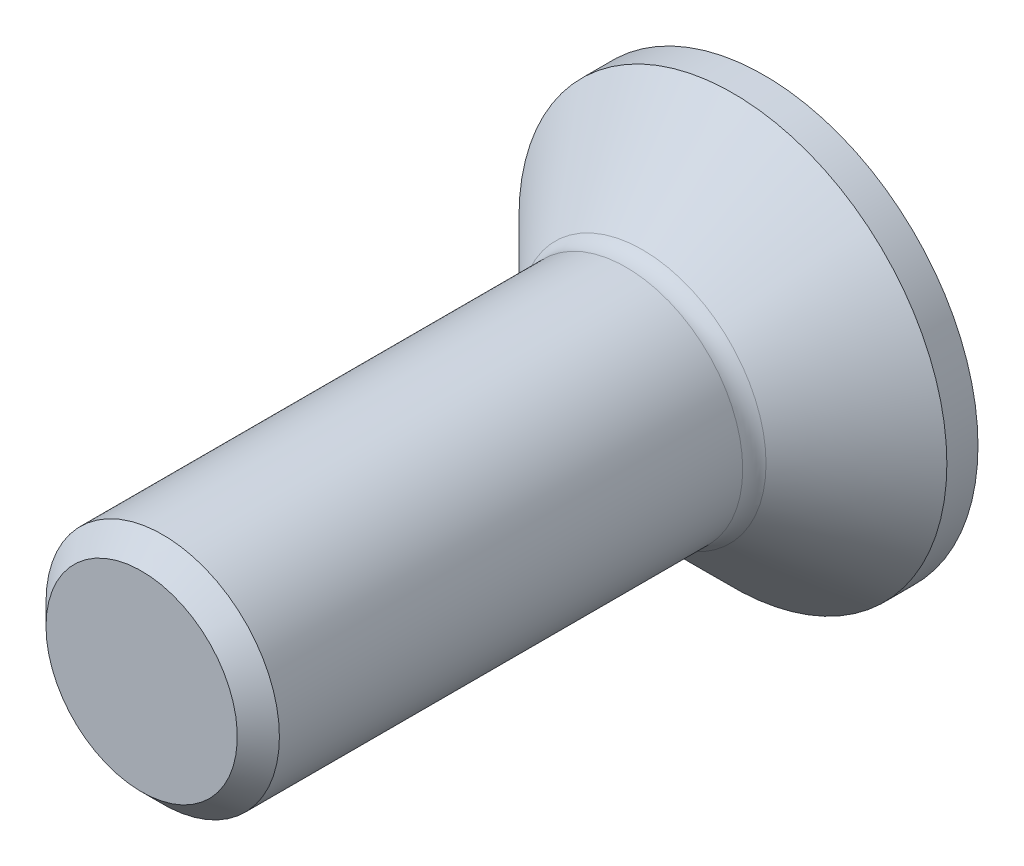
ISO-10303-21;
HEADER;
FILE_DESCRIPTION(('STEP AP214'),'2;1');
FILE_NAME('part.step','',(''),(''),'','','');
FILE_SCHEMA(('AUTOMOTIVE_DESIGN { 1 0 10303 214 1 1 1 1 }'));
ENDSEC;
DATA;
#1=APPLICATION_CONTEXT('core data for automotive mechanical design processes');
#2=APPLICATION_PROTOCOL_DEFINITION('international standard','automotive_design',2000,#1);
#3=PRODUCT_CONTEXT('',#1,'mechanical');
#4=PRODUCT('Part','Part','',(#3));
#5=PRODUCT_RELATED_PRODUCT_CATEGORY('part','',(#4));
#6=PRODUCT_DEFINITION_FORMATION('','',#4);
#7=PRODUCT_DEFINITION_CONTEXT('part definition',#1,'design');
#8=PRODUCT_DEFINITION('design','',#6,#7);
#9=PRODUCT_DEFINITION_SHAPE('','',#8);
#10=(LENGTH_UNIT() NAMED_UNIT(*) SI_UNIT(.MILLI.,.METRE.));
#11=(NAMED_UNIT(*) PLANE_ANGLE_UNIT() SI_UNIT($,.RADIAN.));
#12=(NAMED_UNIT(*) SI_UNIT($,.STERADIAN.) SOLID_ANGLE_UNIT());
#13=UNCERTAINTY_MEASURE_WITH_UNIT(LENGTH_MEASURE(1.E-05),#10,'distance_accuracy_value','');
#14=(GEOMETRIC_REPRESENTATION_CONTEXT(3) GLOBAL_UNCERTAINTY_ASSIGNED_CONTEXT((#13)) GLOBAL_UNIT_ASSIGNED_CONTEXT((#10,
#11,#12)) REPRESENTATION_CONTEXT('',''));
#15=CARTESIAN_POINT('',(0.,0.,0.));
#16=DIRECTION('',(0.,0.,1.));
#17=DIRECTION('',(1.,0.,0.));
#18=AXIS2_PLACEMENT_3D('',#15,#16,#17);
#19=CARTESIAN_POINT('',(0.,0.,-0.599999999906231));
#20=DIRECTION('',(0.,0.,-1.));
#21=DIRECTION('',(-1.,0.,0.));
#22=AXIS2_PLACEMENT_3D('',#19,#20,#21);
#23=CONICAL_SURFACE('',#22,0.999999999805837,1.04719755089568);
#24=CARTESIAN_POINT('',(0.,0.,-0.0226497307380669));
#25=VERTEX_POINT('',#24);
#26=VERTEX_LOOP('',#25);
#27=FACE_BOUND('',#26,.T.);
#28=CARTESIAN_POINT('',(0.,0.,-0.600000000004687));
#29=DIRECTION('',(0.,0.,-1.));
#30=DIRECTION('',(-1.,0.,0.));
#31=AXIS2_PLACEMENT_3D('',#28,#29,#30);
#32=CIRCLE('',#31,0.999999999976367);
#33=CARTESIAN_POINT('',(0.,0.999999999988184,-0.600000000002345));
#34=VERTEX_POINT('',#33);
#35=CARTESIAN_POINT('',(0.866025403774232,0.499999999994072,-0.600000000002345));
#36=VERTEX_POINT('',#35);
#37=EDGE_CURVE('E141',#34,#36,#32,.T.);
#38=ORIENTED_EDGE('',*,*,#37,.T.);
#39=CARTESIAN_POINT('',(0.,0.,-0.600000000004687));
#40=DIRECTION('',(0.,0.,-1.));
#41=DIRECTION('',(-1.,0.,0.));
#42=AXIS2_PLACEMENT_3D('',#39,#40,#41);
#43=CIRCLE('',#42,0.999999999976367);
#44=CARTESIAN_POINT('',(0.866025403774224,-0.499999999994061,-0.600000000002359));
#45=VERTEX_POINT('',#44);
#46=EDGE_CURVE('E93',#36,#45,#43,.T.);
#47=ORIENTED_EDGE('',*,*,#46,.T.);
#48=CARTESIAN_POINT('',(0.,0.,-0.600000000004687));
#49=DIRECTION('',(0.,0.,-1.));
#50=DIRECTION('',(-1.,0.,0.));
#51=AXIS2_PLACEMENT_3D('',#48,#49,#50);
#52=CIRCLE('',#51,0.999999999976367);
#53=CARTESIAN_POINT('',(0.,-0.999999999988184,-0.600000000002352));
#54=VERTEX_POINT('',#53);
#55=EDGE_CURVE('E88',#45,#54,#52,.T.);
#56=ORIENTED_EDGE('',*,*,#55,.T.);
#57=CARTESIAN_POINT('',(0.,0.,-0.600000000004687));
#58=DIRECTION('',(0.,0.,-1.));
#59=DIRECTION('',(-1.,0.,0.));
#60=AXIS2_PLACEMENT_3D('',#57,#58,#59);
#61=CIRCLE('',#60,0.999999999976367);
#62=CARTESIAN_POINT('',(-0.866025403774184,-0.49999999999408,-0.600000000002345));
#63=VERTEX_POINT('',#62);
#64=EDGE_CURVE('E20',#54,#63,#61,.T.);
#65=ORIENTED_EDGE('',*,*,#64,.T.);
#66=CARTESIAN_POINT('',(0.,0.,-0.600000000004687));
#67=DIRECTION('',(0.,0.,-1.));
#68=DIRECTION('',(-1.,0.,0.));
#69=AXIS2_PLACEMENT_3D('',#66,#67,#68);
#70=CIRCLE('',#69,0.999999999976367);
#71=CARTESIAN_POINT('',(-0.866025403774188,0.499999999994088,-0.600000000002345));
#72=VERTEX_POINT('',#71);
#73=EDGE_CURVE('E114',#63,#72,#70,.T.);
#74=ORIENTED_EDGE('',*,*,#73,.T.);
#75=CARTESIAN_POINT('',(0.,0.,-0.600000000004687));
#76=DIRECTION('',(0.,0.,-1.));
#77=DIRECTION('',(-1.,0.,0.));
#78=AXIS2_PLACEMENT_3D('',#75,#76,#77);
#79=CIRCLE('',#78,0.999999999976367);
#80=EDGE_CURVE('E143',#72,#34,#79,.T.);
#81=ORIENTED_EDGE('',*,*,#80,.T.);
#82=EDGE_LOOP('',(#38,#47,#56,#65,#74,#81));
#83=FACE_BOUND('',#82,.T.);
#84=ADVANCED_FACE('F16',(#27,#83),#23,.F.);
#85=CARTESIAN_POINT('',(0.57735026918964,1.,-0.600000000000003));
#86=DIRECTION('',(0.,0.,1.));
#87=DIRECTION('',(1.,0.,0.));
#88=AXIS2_PLACEMENT_3D('',#85,#86,#87);
#89=PLANE('',#88);
#90=DIRECTION('',(0.499999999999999,-0.866025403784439,0.));
#91=VECTOR('',#90,1.);
#92=CARTESIAN_POINT('',(-1.15470053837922,0.,-0.600000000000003));
#93=LINE('',#92,#91);
#94=CARTESIAN_POINT('',(-0.577350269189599,-0.999999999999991,-0.600000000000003));
#95=VERTEX_POINT('',#94);
#96=EDGE_CURVE('E112',#95,#63,#93,.F.);
#97=ORIENTED_EDGE('',*,*,#96,.T.);
#98=ORIENTED_EDGE('',*,*,#64,.F.);
#99=DIRECTION('',(1.,0.,0.));
#100=VECTOR('',#99,1.);
#101=CARTESIAN_POINT('',(-0.577350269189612,-1.,-0.600000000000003));
#102=LINE('',#101,#100);
#103=EDGE_CURVE('E106',#54,#95,#102,.F.);
#104=ORIENTED_EDGE('',*,*,#103,.T.);
#105=EDGE_LOOP('',(#97,#98,#104));
#106=FACE_BOUND('',#105,.T.);
#107=ADVANCED_FACE('F109',(#106),#89,.F.);
#108=CARTESIAN_POINT('',(0.57735026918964,1.,-0.600000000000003));
#109=DIRECTION('',(0.,0.,1.));
#110=DIRECTION('',(1.,0.,0.));
#111=AXIS2_PLACEMENT_3D('',#108,#109,#110);
#112=PLANE('',#111);
#113=DIRECTION('',(-0.499999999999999,-0.866025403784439,0.));
#114=VECTOR('',#113,1.);
#115=CARTESIAN_POINT('',(-0.577350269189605,0.999999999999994,-0.600000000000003));
#116=LINE('',#115,#114);
#117=CARTESIAN_POINT('',(-1.15470053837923,0.,-0.600000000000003));
#118=VERTEX_POINT('',#117);
#119=EDGE_CURVE('E150',#118,#72,#116,.F.);
#120=ORIENTED_EDGE('',*,*,#119,.T.);
#121=ORIENTED_EDGE('',*,*,#73,.F.);
#122=DIRECTION('',(0.499999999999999,-0.866025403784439,0.));
#123=VECTOR('',#122,1.);
#124=CARTESIAN_POINT('',(-1.15470053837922,0.,-0.600000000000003));
#125=LINE('',#124,#123);
#126=EDGE_CURVE('E152',#63,#118,#125,.F.);
#127=ORIENTED_EDGE('',*,*,#126,.T.);
#128=EDGE_LOOP('',(#120,#121,#127));
#129=FACE_BOUND('',#128,.T.);
#130=ADVANCED_FACE('F151',(#129),#112,.F.);
#131=CARTESIAN_POINT('',(0.57735026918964,1.,-0.600000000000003));
#132=DIRECTION('',(0.,0.,1.));
#133=DIRECTION('',(1.,0.,0.));
#134=AXIS2_PLACEMENT_3D('',#131,#132,#133);
#135=PLANE('',#134);
#136=DIRECTION('',(-1.,0.,0.));
#137=VECTOR('',#136,1.);
#138=CARTESIAN_POINT('',(0.57735026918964,1.,-0.600000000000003));
#139=LINE('',#138,#137);
#140=CARTESIAN_POINT('',(-0.577350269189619,0.999999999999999,-0.600000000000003));
#141=VERTEX_POINT('',#140);
#142=EDGE_CURVE('E164',#141,#34,#139,.F.);
#143=ORIENTED_EDGE('',*,*,#142,.T.);
#144=ORIENTED_EDGE('',*,*,#80,.F.);
#145=DIRECTION('',(-0.499999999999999,-0.866025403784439,0.));
#146=VECTOR('',#145,1.);
#147=CARTESIAN_POINT('',(-0.577350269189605,0.999999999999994,-0.600000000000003));
#148=LINE('',#147,#146);
#149=EDGE_CURVE('E157',#72,#141,#148,.F.);
#150=ORIENTED_EDGE('',*,*,#149,.T.);
#151=EDGE_LOOP('',(#143,#144,#150));
#152=FACE_BOUND('',#151,.T.);
#153=ADVANCED_FACE('F161',(#152),#135,.F.);
#154=CARTESIAN_POINT('',(0.57735026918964,1.,-0.600000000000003));
#155=DIRECTION('',(0.,0.,1.));
#156=DIRECTION('',(1.,0.,0.));
#157=AXIS2_PLACEMENT_3D('',#154,#155,#156);
#158=PLANE('',#157);
#159=DIRECTION('',(-0.499999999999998,0.86602540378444,0.));
#160=VECTOR('',#159,1.);
#161=CARTESIAN_POINT('',(1.15470053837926,0.,-0.600000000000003));
#162=LINE('',#161,#160);
#163=CARTESIAN_POINT('',(0.577350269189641,1.,-0.600000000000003));
#164=VERTEX_POINT('',#163);
#165=EDGE_CURVE('E220',#164,#36,#162,.F.);
#166=ORIENTED_EDGE('',*,*,#165,.T.);
#167=ORIENTED_EDGE('',*,*,#37,.F.);
#168=DIRECTION('',(-1.,0.,0.));
#169=VECTOR('',#168,1.);
#170=CARTESIAN_POINT('',(0.57735026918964,1.,-0.600000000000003));
#171=LINE('',#170,#169);
#172=EDGE_CURVE('E214',#34,#164,#171,.F.);
#173=ORIENTED_EDGE('',*,*,#172,.T.);
#174=EDGE_LOOP('',(#166,#167,#173));
#175=FACE_BOUND('',#174,.T.);
#176=ADVANCED_FACE('F315',(#175),#158,.F.);
#177=CARTESIAN_POINT('',(0.57735026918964,1.,-0.600000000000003));
#178=DIRECTION('',(0.,0.,1.));
#179=DIRECTION('',(1.,0.,0.));
#180=AXIS2_PLACEMENT_3D('',#177,#178,#179);
#181=PLANE('',#180);
#182=DIRECTION('',(0.499999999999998,0.86602540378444,0.));
#183=VECTOR('',#182,1.);
#184=CARTESIAN_POINT('',(0.577350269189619,-0.999999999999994,-0.600000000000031));
#185=LINE('',#184,#183);
#186=CARTESIAN_POINT('',(1.15470053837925,0.,-0.600000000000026));
#187=VERTEX_POINT('',#186);
#188=EDGE_CURVE('E242',#187,#45,#185,.F.);
#189=ORIENTED_EDGE('',*,*,#188,.T.);
#190=ORIENTED_EDGE('',*,*,#46,.F.);
#191=DIRECTION('',(-0.499999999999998,0.86602540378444,0.));
#192=VECTOR('',#191,1.);
#193=CARTESIAN_POINT('',(1.15470053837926,0.,-0.600000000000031));
#194=LINE('',#193,#192);
#195=EDGE_CURVE('E228',#36,#187,#194,.F.);
#196=ORIENTED_EDGE('',*,*,#195,.T.);
#197=EDGE_LOOP('',(#189,#190,#196));
#198=FACE_BOUND('',#197,.T.);
#199=ADVANCED_FACE('F312',(#198),#181,.F.);
#200=CARTESIAN_POINT('',(0.57735026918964,1.,-0.600000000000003));
#201=DIRECTION('',(0.,0.,1.));
#202=DIRECTION('',(1.,0.,0.));
#203=AXIS2_PLACEMENT_3D('',#200,#201,#202);
#204=PLANE('',#203);
#205=DIRECTION('',(1.,0.,0.));
#206=VECTOR('',#205,1.);
#207=CARTESIAN_POINT('',(-0.577350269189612,-1.,-0.600000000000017));
#208=LINE('',#207,#206);
#209=CARTESIAN_POINT('',(0.57735026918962,-0.999999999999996,-0.600000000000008));
#210=VERTEX_POINT('',#209);
#211=EDGE_CURVE('E97',#210,#54,#208,.F.);
#212=ORIENTED_EDGE('',*,*,#211,.T.);
#213=ORIENTED_EDGE('',*,*,#55,.F.);
#214=DIRECTION('',(0.499999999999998,0.86602540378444,0.));
#215=VECTOR('',#214,1.);
#216=CARTESIAN_POINT('',(0.577350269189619,-0.999999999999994,-0.600000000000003));
#217=LINE('',#216,#215);
#218=EDGE_CURVE('E101',#45,#210,#217,.F.);
#219=ORIENTED_EDGE('',*,*,#218,.T.);
#220=EDGE_LOOP('',(#212,#213,#219));
#221=FACE_BOUND('',#220,.T.);
#222=ADVANCED_FACE('F100',(#221),#204,.F.);
#223=CARTESIAN_POINT('',(-0.577350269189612,-1.,-0.600000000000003));
#224=DIRECTION('',(0.,-1.,0.));
#225=DIRECTION('',(1.,0.,0.));
#226=AXIS2_PLACEMENT_3D('',#223,#224,#225);
#227=PLANE('',#226);
#228=DIRECTION('',(0.,0.,1.));
#229=VECTOR('',#228,1.);
#230=CARTESIAN_POINT('',(-0.577350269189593,-0.999999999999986,-0.600000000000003));
#231=LINE('',#230,#229);
#232=CARTESIAN_POINT('',(-0.577350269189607,-0.999999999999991,-1.65000000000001));
#233=VERTEX_POINT('',#232);
#234=EDGE_CURVE('E117',#233,#95,#231,.T.);
#235=ORIENTED_EDGE('',*,*,#234,.T.);
#236=ORIENTED_EDGE('',*,*,#103,.F.);
#237=ORIENTED_EDGE('',*,*,#211,.F.);
#238=DIRECTION('',(0.,0.,1.));
#239=VECTOR('',#238,1.);
#240=CARTESIAN_POINT('',(0.577350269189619,-0.999999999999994,-0.600000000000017));
#241=LINE('',#240,#239);
#242=CARTESIAN_POINT('',(0.577350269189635,-0.999999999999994,-1.65));
#243=VERTEX_POINT('',#242);
#244=EDGE_CURVE('E128',#210,#243,#241,.F.);
#245=ORIENTED_EDGE('',*,*,#244,.T.);
#246=DIRECTION('',(1.,0.,0.));
#247=VECTOR('',#246,1.);
#248=CARTESIAN_POINT('',(0.,-0.99999999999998,-1.65000000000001));
#249=LINE('',#248,#247);
#250=EDGE_CURVE('E125',#243,#233,#249,.F.);
#251=ORIENTED_EDGE('',*,*,#250,.T.);
#252=EDGE_LOOP('',(#235,#236,#237,#245,#251));
#253=FACE_BOUND('',#252,.T.);
#254=ADVANCED_FACE('F115',(#253),#227,.F.);
#255=CARTESIAN_POINT('',(-1.15470053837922,0.,-0.600000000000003));
#256=DIRECTION('',(-0.866025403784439,-0.499999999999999,0.));
#257=DIRECTION('',(0.499999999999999,-0.866025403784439,0.));
#258=AXIS2_PLACEMENT_3D('',#255,#256,#257);
#259=PLANE('',#258);
#260=DIRECTION('',(0.,0.,1.));
#261=VECTOR('',#260,1.);
#262=CARTESIAN_POINT('',(-1.15470053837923,0.,-0.600000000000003));
#263=LINE('',#262,#261);
#264=CARTESIAN_POINT('',(-1.15470053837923,0.,-1.65000000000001));
#265=VERTEX_POINT('',#264);
#266=EDGE_CURVE('E158',#265,#118,#263,.T.);
#267=ORIENTED_EDGE('',*,*,#266,.T.);
#268=ORIENTED_EDGE('',*,*,#126,.F.);
#269=ORIENTED_EDGE('',*,*,#96,.F.);
#270=ORIENTED_EDGE('',*,*,#234,.F.);
#271=DIRECTION('',(-0.5,0.866025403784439,0.));
#272=VECTOR('',#271,1.);
#273=CARTESIAN_POINT('',(-0.577350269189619,-1.,-1.65000000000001));
#274=LINE('',#273,#272);
#275=EDGE_CURVE('E127',#233,#265,#274,.T.);
#276=ORIENTED_EDGE('',*,*,#275,.T.);
#277=EDGE_LOOP('',(#267,#268,#269,#270,#276));
#278=FACE_BOUND('',#277,.T.);
#279=ADVANCED_FACE('F196',(#278),#259,.F.);
#280=CARTESIAN_POINT('',(-0.577350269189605,0.999999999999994,-0.600000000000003));
#281=DIRECTION('',(-0.866025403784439,0.499999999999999,0.));
#282=DIRECTION('',(-0.499999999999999,-0.866025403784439,0.));
#283=AXIS2_PLACEMENT_3D('',#280,#281,#282);
#284=PLANE('',#283);
#285=DIRECTION('',(0.,0.,1.));
#286=VECTOR('',#285,1.);
#287=CARTESIAN_POINT('',(-0.577350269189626,1.,-0.600000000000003));
#288=LINE('',#287,#286);
#289=CARTESIAN_POINT('',(-0.577350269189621,1.,-1.65000000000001));
#290=VERTEX_POINT('',#289);
#291=EDGE_CURVE('E168',#290,#141,#288,.T.);
#292=ORIENTED_EDGE('',*,*,#291,.T.);
#293=ORIENTED_EDGE('',*,*,#149,.F.);
#294=ORIENTED_EDGE('',*,*,#119,.F.);
#295=ORIENTED_EDGE('',*,*,#266,.F.);
#296=DIRECTION('',(0.499999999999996,0.866025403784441,0.));
#297=VECTOR('',#296,1.);
#298=CARTESIAN_POINT('',(-1.15470053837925,0.,-1.65000000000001));
#299=LINE('',#298,#297);
#300=EDGE_CURVE('E176',#265,#290,#299,.T.);
#301=ORIENTED_EDGE('',*,*,#300,.T.);
#302=EDGE_LOOP('',(#292,#293,#294,#295,#301));
#303=FACE_BOUND('',#302,.T.);
#304=ADVANCED_FACE('F166',(#303),#284,.F.);
#305=CARTESIAN_POINT('',(0.57735026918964,1.,-0.600000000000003));
#306=DIRECTION('',(0.,1.,0.));
#307=DIRECTION('',(-1.,0.,0.));
#308=AXIS2_PLACEMENT_3D('',#305,#306,#307);
#309=PLANE('',#308);
#310=DIRECTION('',(0.,0.,1.));
#311=VECTOR('',#310,1.);
#312=CARTESIAN_POINT('',(0.577350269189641,1.00000000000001,-0.600000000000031));
#313=LINE('',#312,#311);
#314=CARTESIAN_POINT('',(0.577350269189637,1.,-1.65000000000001));
#315=VERTEX_POINT('',#314);
#316=EDGE_CURVE('E216',#315,#164,#313,.T.);
#317=ORIENTED_EDGE('',*,*,#316,.T.);
#318=ORIENTED_EDGE('',*,*,#172,.F.);
#319=ORIENTED_EDGE('',*,*,#142,.F.);
#320=ORIENTED_EDGE('',*,*,#291,.F.);
#321=DIRECTION('',(1.,0.,0.));
#322=VECTOR('',#321,1.);
#323=CARTESIAN_POINT('',(0.,1.,-1.65000000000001));
#324=LINE('',#323,#322);
#325=EDGE_CURVE('E178',#290,#315,#324,.T.);
#326=ORIENTED_EDGE('',*,*,#325,.T.);
#327=EDGE_LOOP('',(#317,#318,#319,#320,#326));
#328=FACE_BOUND('',#327,.T.);
#329=ADVANCED_FACE('F301',(#328),#309,.F.);
#330=CARTESIAN_POINT('',(1.15470053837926,0.,-0.600000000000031));
#331=DIRECTION('',(0.86602540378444,0.499999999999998,0.));
#332=DIRECTION('',(-0.499999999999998,0.86602540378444,0.));
#333=AXIS2_PLACEMENT_3D('',#330,#331,#332);
#334=PLANE('',#333);
#335=DIRECTION('',(0.,0.,1.));
#336=VECTOR('',#335,1.);
#337=CARTESIAN_POINT('',(1.15470053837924,0.,-0.600000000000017));
#338=LINE('',#337,#336);
#339=CARTESIAN_POINT('',(1.15470053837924,0.,-1.65));
#340=VERTEX_POINT('',#339);
#341=EDGE_CURVE('E238',#340,#187,#338,.T.);
#342=ORIENTED_EDGE('',*,*,#341,.T.);
#343=ORIENTED_EDGE('',*,*,#195,.F.);
#344=ORIENTED_EDGE('',*,*,#165,.F.);
#345=ORIENTED_EDGE('',*,*,#316,.F.);
#346=DIRECTION('',(0.499999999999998,-0.86602540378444,0.));
#347=VECTOR('',#346,1.);
#348=CARTESIAN_POINT('',(0.577350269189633,1.,-1.65000000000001));
#349=LINE('',#348,#347);
#350=EDGE_CURVE('E35',#315,#340,#349,.T.);
#351=ORIENTED_EDGE('',*,*,#350,.T.);
#352=EDGE_LOOP('',(#342,#343,#344,#345,#351));
#353=FACE_BOUND('',#352,.T.);
#354=ADVANCED_FACE('F297',(#353),#334,.F.);
#355=CARTESIAN_POINT('',(0.577350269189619,-0.999999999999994,-0.600000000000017));
#356=DIRECTION('',(0.86602540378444,-0.499999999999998,0.));
#357=DIRECTION('',(0.499999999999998,0.86602540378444,0.));
#358=AXIS2_PLACEMENT_3D('',#355,#356,#357);
#359=PLANE('',#358);
#360=ORIENTED_EDGE('',*,*,#244,.F.);
#361=ORIENTED_EDGE('',*,*,#218,.F.);
#362=ORIENTED_EDGE('',*,*,#188,.F.);
#363=ORIENTED_EDGE('',*,*,#341,.F.);
#364=DIRECTION('',(-0.499999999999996,-0.866025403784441,0.));
#365=VECTOR('',#364,1.);
#366=CARTESIAN_POINT('',(1.15470053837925,0.,-1.65000000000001));
#367=LINE('',#366,#365);
#368=EDGE_CURVE('E138',#340,#243,#367,.T.);
#369=ORIENTED_EDGE('',*,*,#368,.T.);
#370=EDGE_LOOP('',(#360,#361,#362,#363,#369));
#371=FACE_BOUND('',#370,.T.);
#372=ADVANCED_FACE('F293',(#371),#359,.F.);
#373=CARTESIAN_POINT('',(0.,3.15000000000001,-1.65000000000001));
#374=DIRECTION('',(0.,0.,1.));
#375=DIRECTION('',(1.,0.,0.));
#376=AXIS2_PLACEMENT_3D('',#373,#374,#375);
#377=PLANE('',#376);
#378=CARTESIAN_POINT('',(0.,0.,-1.65));
#379=DIRECTION('',(0.,0.,-1.));
#380=DIRECTION('',(-1.,0.,0.));
#381=AXIS2_PLACEMENT_3D('',#378,#379,#380);
#382=CIRCLE('',#381,2.75);
#383=CARTESIAN_POINT('',(-2.74999999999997,0.,-1.65));
#384=VERTEX_POINT('',#383);
#385=EDGE_CURVE('E135',#384,#384,#382,.F.);
#386=ORIENTED_EDGE('',*,*,#385,.F.);
#387=EDGE_LOOP('',(#386));
#388=FACE_BOUND('',#387,.T.);
#389=ORIENTED_EDGE('',*,*,#350,.F.);
#390=ORIENTED_EDGE('',*,*,#325,.F.);
#391=ORIENTED_EDGE('',*,*,#300,.F.);
#392=ORIENTED_EDGE('',*,*,#275,.F.);
#393=ORIENTED_EDGE('',*,*,#250,.F.);
#394=ORIENTED_EDGE('',*,*,#368,.F.);
#395=EDGE_LOOP('',(#389,#390,#391,#392,#393,#394));
#396=FACE_BOUND('',#395,.T.);
#397=ADVANCED_FACE('F201',(#388,#396),#377,.F.);
#398=CARTESIAN_POINT('',(0.,0.,6.34999999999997));
#399=DIRECTION('',(0.,0.,-1.));
#400=DIRECTION('',(-1.,0.,0.));
#401=AXIS2_PLACEMENT_3D('',#398,#399,#400);
#402=CYLINDRICAL_SURFACE('',#401,2.75);
#403=CARTESIAN_POINT('',(0.,0.,-1.24999999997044));
#404=DIRECTION('',(0.,0.,-1.));
#405=DIRECTION('',(-1.,0.,0.));
#406=AXIS2_PLACEMENT_3D('',#403,#404,#405);
#407=CIRCLE('',#406,2.74999999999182);
#408=CARTESIAN_POINT('',(-2.74999999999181,0.,-1.24999999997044));
#409=VERTEX_POINT('',#408);
#410=EDGE_CURVE('E137',#409,#409,#407,.F.);
#411=ORIENTED_EDGE('',*,*,#410,.F.);
#412=EDGE_LOOP('',(#411));
#413=FACE_BOUND('',#412,.T.);
#414=ORIENTED_EDGE('',*,*,#385,.T.);
#415=EDGE_LOOP('',(#414));
#416=FACE_BOUND('',#415,.T.);
#417=ADVANCED_FACE('F283',(#413,#416),#402,.T.);
#418=CARTESIAN_POINT('',(0.,0.,-1.2499999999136));
#419=DIRECTION('',(0.,0.,-1.));
#420=DIRECTION('',(-1.,0.,0.));
#421=AXIS2_PLACEMENT_3D('',#418,#419,#420);
#422=CONICAL_SURFACE('',#421,2.74999999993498,0.785398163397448);
#423=CARTESIAN_POINT('',(0.,0.,-0.0878679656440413));
#424=DIRECTION('',(0.,0.,1.));
#425=DIRECTION('',(1.,0.,0.));
#426=AXIS2_PLACEMENT_3D('',#423,#424,#425);
#427=CIRCLE('',#426,1.58786796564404);
#428=CARTESIAN_POINT('',(1.58786796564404,0.,-0.0878679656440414));
#429=VERTEX_POINT('',#428);
#430=EDGE_CURVE('E134',#429,#429,#427,.F.);
#431=ORIENTED_EDGE('',*,*,#430,.T.);
#432=EDGE_LOOP('',(#431));
#433=FACE_BOUND('',#432,.T.);
#434=ORIENTED_EDGE('',*,*,#410,.T.);
#435=EDGE_LOOP('',(#434));
#436=FACE_BOUND('',#435,.T.);
#437=ADVANCED_FACE('F280',(#433,#436),#422,.T.);
#438=CARTESIAN_POINT('',(0.,1.50000000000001,6.34999999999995));
#439=DIRECTION('',(0.,0.,-1.));
#440=DIRECTION('',(-1.,0.,0.));
#441=AXIS2_PLACEMENT_3D('',#438,#439,#440);
#442=PLANE('',#441);
#443=CARTESIAN_POINT('',(0.,0.,6.34999999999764));
#444=DIRECTION('',(0.,0.,-1.));
#445=DIRECTION('',(-1.,0.,0.));
#446=AXIS2_PLACEMENT_3D('',#443,#444,#445);
#447=CIRCLE('',#446,1.22937499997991);
#448=CARTESIAN_POINT('',(-1.22937499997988,0.,6.34999999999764));
#449=VERTEX_POINT('',#448);
#450=EDGE_CURVE('E131',#449,#449,#447,.T.);
#451=ORIENTED_EDGE('',*,*,#450,.F.);
#452=EDGE_LOOP('',(#451));
#453=FACE_BOUND('',#452,.T.);
#454=ADVANCED_FACE('F266',(#453),#442,.F.);
#455=CARTESIAN_POINT('',(0.,0.,0.124264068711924));
#456=DIRECTION('',(0.,0.,1.));
#457=DIRECTION('',(1.,0.,0.));
#458=AXIS2_PLACEMENT_3D('',#455,#456,#457);
#459=TOROIDAL_SURFACE('',#458,1.8,0.3);
#460=ORIENTED_EDGE('',*,*,#430,.F.);
#461=EDGE_LOOP('',(#460));
#462=FACE_BOUND('',#461,.T.);
#463=CARTESIAN_POINT('',(0.,0.,0.124264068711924));
#464=DIRECTION('',(0.,0.,1.));
#465=DIRECTION('',(1.,0.,0.));
#466=AXIS2_PLACEMENT_3D('',#463,#464,#465);
#467=CIRCLE('',#466,1.5);
#468=CARTESIAN_POINT('',(1.50000000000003,0.,0.124264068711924));
#469=VERTEX_POINT('',#468);
#470=EDGE_CURVE('E26',#469,#469,#467,.T.);
#471=ORIENTED_EDGE('',*,*,#470,.F.);
#472=EDGE_LOOP('',(#471));
#473=FACE_BOUND('',#472,.T.);
#474=ADVANCED_FACE('F262',(#462,#473),#459,.F.);
#475=CARTESIAN_POINT('',(0.,0.,6.07937500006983));
#476=DIRECTION('',(0.,0.,-1.));
#477=DIRECTION('',(-1.,0.,0.));
#478=AXIS2_PLACEMENT_3D('',#475,#476,#477);
#479=CONICAL_SURFACE('',#478,1.49999999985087,0.785398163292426);
#480=CARTESIAN_POINT('',(0.,0.,6.07937499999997));
#481=DIRECTION('',(0.,0.,1.));
#482=DIRECTION('',(1.,0.,0.));
#483=AXIS2_PLACEMENT_3D('',#480,#481,#482);
#484=CIRCLE('',#483,1.5);
#485=CARTESIAN_POINT('',(1.50000000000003,0.,6.07937499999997));
#486=VERTEX_POINT('',#485);
#487=EDGE_CURVE('E10',#486,#486,#484,.F.);
#488=ORIENTED_EDGE('',*,*,#487,.F.);
#489=EDGE_LOOP('',(#488));
#490=FACE_BOUND('',#489,.T.);
#491=ORIENTED_EDGE('',*,*,#450,.T.);
#492=EDGE_LOOP('',(#491));
#493=FACE_BOUND('',#492,.T.);
#494=ADVANCED_FACE('F265',(#490,#493),#479,.T.);
#495=CARTESIAN_POINT('',(0.,0.,6.34999999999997));
#496=DIRECTION('',(0.,0.,1.));
#497=DIRECTION('',(1.,0.,0.));
#498=AXIS2_PLACEMENT_3D('',#495,#496,#497);
#499=CYLINDRICAL_SURFACE('',#498,1.5);
#500=ORIENTED_EDGE('',*,*,#470,.T.);
#501=EDGE_LOOP('',(#500));
#502=FACE_BOUND('',#501,.T.);
#503=ORIENTED_EDGE('',*,*,#487,.T.);
#504=EDGE_LOOP('',(#503));
#505=FACE_BOUND('',#504,.T.);
#506=ADVANCED_FACE('F18',(#502,#505),#499,.T.);
#507=CLOSED_SHELL('',(#84,#107,#130,#153,#176,#199,#222,#254,#279,#304,#329,#354,#372,#397,#417,
#437,#454,#474,#494,#506));
#508=MANIFOLD_SOLID_BREP('B1',#507);
#509=ADVANCED_BREP_SHAPE_REPRESENTATION('',(#18,#508),#14);
#510=SHAPE_DEFINITION_REPRESENTATION(#9,#509);
ENDSEC;
END-ISO-10303-21;
